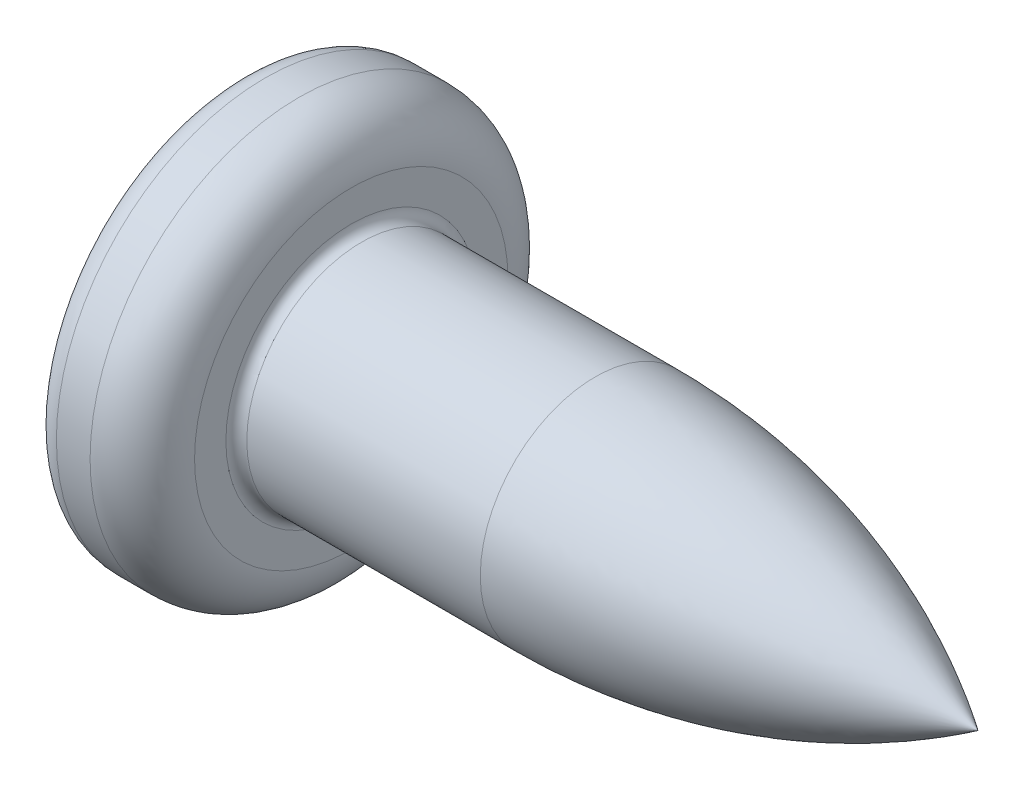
ISO-10303-21;
HEADER;
FILE_DESCRIPTION(('STEP AP214'),'2;1');
FILE_NAME('part.step','',(''),(''),'','','');
FILE_SCHEMA(('AUTOMOTIVE_DESIGN { 1 0 10303 214 1 1 1 1 }'));
ENDSEC;
DATA;
#1=APPLICATION_CONTEXT('core data for automotive mechanical design processes');
#2=APPLICATION_PROTOCOL_DEFINITION('international standard','automotive_design',2000,#1);
#3=PRODUCT_CONTEXT('',#1,'mechanical');
#4=PRODUCT('Part','Part','',(#3));
#5=PRODUCT_RELATED_PRODUCT_CATEGORY('part','',(#4));
#6=PRODUCT_DEFINITION_FORMATION('','',#4);
#7=PRODUCT_DEFINITION_CONTEXT('part definition',#1,'design');
#8=PRODUCT_DEFINITION('design','',#6,#7);
#9=PRODUCT_DEFINITION_SHAPE('','',#8);
#10=(LENGTH_UNIT() NAMED_UNIT(*) SI_UNIT(.MILLI.,.METRE.));
#11=(NAMED_UNIT(*) PLANE_ANGLE_UNIT() SI_UNIT($,.RADIAN.));
#12=(NAMED_UNIT(*) SI_UNIT($,.STERADIAN.) SOLID_ANGLE_UNIT());
#13=UNCERTAINTY_MEASURE_WITH_UNIT(LENGTH_MEASURE(1.E-05),#10,'distance_accuracy_value','');
#14=(GEOMETRIC_REPRESENTATION_CONTEXT(3) GLOBAL_UNCERTAINTY_ASSIGNED_CONTEXT((#13)) GLOBAL_UNIT_ASSIGNED_CONTEXT((#10,
#11,#12)) REPRESENTATION_CONTEXT('',''));
#15=CARTESIAN_POINT('',(0.,0.,0.));
#16=DIRECTION('',(0.,0.,1.));
#17=DIRECTION('',(1.,0.,0.));
#18=AXIS2_PLACEMENT_3D('',#15,#16,#17);
#19=CARTESIAN_POINT('',(4.,0.,0.));
#20=DIRECTION('',(-1.,0.,0.));
#21=DIRECTION('',(0.,1.,0.));
#22=AXIS2_PLACEMENT_3D('',#19,#20,#21);
#23=SPHERICAL_SURFACE('',#22,4.);
#24=CARTESIAN_POINT('',(0.465266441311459,0.,0.));
#25=DIRECTION('',(-1.,0.,0.));
#26=DIRECTION('',(0.,0.,1.));
#27=AXIS2_PLACEMENT_3D('',#24,#25,#26);
#28=CIRCLE('',#27,1.87234042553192);
#29=CARTESIAN_POINT('',(0.465266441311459,0.,1.87234042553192));
#30=VERTEX_POINT('',#29);
#31=EDGE_CURVE('E321',#30,#30,#28,.T.);
#32=ORIENTED_EDGE('',*,*,#31,.T.);
#33=EDGE_LOOP('',(#32));
#34=FACE_BOUND('',#33,.T.);
#35=CARTESIAN_POINT('',(0.0543400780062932,0.,0.));
#36=DIRECTION('',(1.,0.,0.));
#37=DIRECTION('',(0.,0.,-1.));
#38=AXIS2_PLACEMENT_3D('',#35,#36,#37);
#39=CIRCLE('',#38,0.657090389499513);
#40=CARTESIAN_POINT('',(0.0543400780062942,-0.369999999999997,-0.543017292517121));
#41=VERTEX_POINT('',#40);
#42=CARTESIAN_POINT('',(0.0543400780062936,-0.543017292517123,-0.37));
#43=VERTEX_POINT('',#42);
#44=EDGE_CURVE('E457',#41,#43,#39,.F.);
#45=ORIENTED_EDGE('',*,*,#44,.F.);
#46=CARTESIAN_POINT('',(4.,-0.37,0.));
#47=DIRECTION('',(0.,1.,0.));
#48=DIRECTION('',(0.,0.,1.));
#49=AXIS2_PLACEMENT_3D('',#46,#47,#48);
#50=CIRCLE('',#49,3.98285073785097);
#51=CARTESIAN_POINT('',(0.201999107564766,-0.369999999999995,-1.19928696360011));
#52=VERTEX_POINT('',#51);
#53=EDGE_CURVE('E283',#52,#41,#50,.T.);
#54=ORIENTED_EDGE('',*,*,#53,.F.);
#55=CARTESIAN_POINT('',(3.72274316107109,0.,0.556091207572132));
#56=DIRECTION('',(0.446197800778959,0.,-0.89493436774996));
#57=DIRECTION('',(-0.89493436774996,0.,-0.446197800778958));
#58=AXIS2_PLACEMENT_3D('',#55,#56,#57);
#59=CIRCLE('',#58,3.95144166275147);
#60=CARTESIAN_POINT('',(0.201999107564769,0.370000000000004,-1.19928696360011));
#61=VERTEX_POINT('',#60);
#62=EDGE_CURVE('E255',#52,#61,#59,.T.);
#63=ORIENTED_EDGE('',*,*,#62,.T.);
#64=CARTESIAN_POINT('',(4.,0.37,0.));
#65=DIRECTION('',(0.,-1.,0.));
#66=DIRECTION('',(0.,0.,-1.));
#67=AXIS2_PLACEMENT_3D('',#64,#65,#66);
#68=CIRCLE('',#67,3.98285073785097);
#69=CARTESIAN_POINT('',(0.0543400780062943,0.370000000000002,-0.543017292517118));
#70=VERTEX_POINT('',#69);
#71=EDGE_CURVE('E291',#70,#61,#68,.T.);
#72=ORIENTED_EDGE('',*,*,#71,.F.);
#73=CARTESIAN_POINT('',(0.0543400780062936,0.543017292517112,-0.37));
#74=VERTEX_POINT('',#73);
#75=EDGE_CURVE('E370',#74,#70,#39,.F.);
#76=ORIENTED_EDGE('',*,*,#75,.F.);
#77=CARTESIAN_POINT('',(4.,0.,-0.37));
#78=DIRECTION('',(0.,0.,1.));
#79=DIRECTION('',(0.,-1.,0.));
#80=AXIS2_PLACEMENT_3D('',#77,#78,#79);
#81=CIRCLE('',#80,3.98285073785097);
#82=CARTESIAN_POINT('',(0.201999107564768,1.19928696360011,-0.37));
#83=VERTEX_POINT('',#82);
#84=EDGE_CURVE('E249',#83,#74,#81,.T.);
#85=ORIENTED_EDGE('',*,*,#84,.F.);
#86=CARTESIAN_POINT('',(3.72274316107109,-0.556091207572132,0.));
#87=DIRECTION('',(0.446197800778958,0.89493436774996,0.));
#88=DIRECTION('',(-0.89493436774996,0.446197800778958,0.));
#89=AXIS2_PLACEMENT_3D('',#86,#87,#88);
#90=CIRCLE('',#89,3.95144166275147);
#91=CARTESIAN_POINT('',(0.201999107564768,1.19928696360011,0.369999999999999));
#92=VERTEX_POINT('',#91);
#93=EDGE_CURVE('E252',#83,#92,#90,.T.);
#94=ORIENTED_EDGE('',*,*,#93,.T.);
#95=CARTESIAN_POINT('',(4.,0.,0.37));
#96=DIRECTION('',(0.,0.,-1.));
#97=DIRECTION('',(0.,1.,0.));
#98=AXIS2_PLACEMENT_3D('',#95,#96,#97);
#99=CIRCLE('',#98,3.98285073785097);
#100=CARTESIAN_POINT('',(0.0543400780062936,0.543017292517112,0.37));
#101=VERTEX_POINT('',#100);
#102=EDGE_CURVE('E245',#101,#92,#99,.T.);
#103=ORIENTED_EDGE('',*,*,#102,.F.);
#104=CARTESIAN_POINT('',(0.054340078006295,0.369999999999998,0.54301729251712));
#105=VERTEX_POINT('',#104);
#106=EDGE_CURVE('E403',#105,#101,#39,.F.);
#107=ORIENTED_EDGE('',*,*,#106,.F.);
#108=CARTESIAN_POINT('',(0.201999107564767,0.369999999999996,1.19928696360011));
#109=VERTEX_POINT('',#108);
#110=EDGE_CURVE('E265',#109,#105,#68,.T.);
#111=ORIENTED_EDGE('',*,*,#110,.F.);
#112=CARTESIAN_POINT('',(3.72274316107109,0.,-0.556091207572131));
#113=DIRECTION('',(0.446197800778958,0.,0.89493436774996));
#114=DIRECTION('',(0.89493436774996,0.,-0.446197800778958));
#115=AXIS2_PLACEMENT_3D('',#112,#113,#114);
#116=CIRCLE('',#115,3.95144166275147);
#117=CARTESIAN_POINT('',(0.201999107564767,-0.370000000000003,1.19928696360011));
#118=VERTEX_POINT('',#117);
#119=EDGE_CURVE('E40',#109,#118,#116,.T.);
#120=ORIENTED_EDGE('',*,*,#119,.T.);
#121=CARTESIAN_POINT('',(0.0543400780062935,-0.370000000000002,0.543017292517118));
#122=VERTEX_POINT('',#121);
#123=EDGE_CURVE('E262',#122,#118,#50,.T.);
#124=ORIENTED_EDGE('',*,*,#123,.F.);
#125=CARTESIAN_POINT('',(0.0543400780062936,-0.543017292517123,0.369999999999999));
#126=VERTEX_POINT('',#125);
#127=EDGE_CURVE('E442',#126,#122,#39,.F.);
#128=ORIENTED_EDGE('',*,*,#127,.F.);
#129=CARTESIAN_POINT('',(0.201999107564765,-1.19928696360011,0.369999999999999));
#130=VERTEX_POINT('',#129);
#131=EDGE_CURVE('E246',#130,#126,#99,.T.);
#132=ORIENTED_EDGE('',*,*,#131,.F.);
#133=CARTESIAN_POINT('',(3.72274316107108,0.556091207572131,0.));
#134=DIRECTION('',(0.446197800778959,-0.89493436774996,0.));
#135=DIRECTION('',(0.89493436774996,0.446197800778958,0.));
#136=AXIS2_PLACEMENT_3D('',#133,#134,#135);
#137=CIRCLE('',#136,3.95144166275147);
#138=CARTESIAN_POINT('',(0.201999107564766,-1.19928696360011,-0.37));
#139=VERTEX_POINT('',#138);
#140=EDGE_CURVE('E242',#130,#139,#137,.T.);
#141=ORIENTED_EDGE('',*,*,#140,.T.);
#142=EDGE_CURVE('E55',#43,#139,#81,.T.);
#143=ORIENTED_EDGE('',*,*,#142,.F.);
#144=EDGE_LOOP('',(#45,#54,#63,#72,#76,#85,#94,#103,#107,#111,#120,#124,#128,#132,#141,#143));
#145=FACE_BOUND('',#144,.T.);
#146=ADVANCED_FACE('F27',(#34,#145),#23,.T.);
#147=CARTESIAN_POINT('',(1.5,0.552127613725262,-0.37));
#148=DIRECTION('',(0.,0.,1.));
#149=DIRECTION('',(0.,-1.,0.));
#150=AXIS2_PLACEMENT_3D('',#147,#148,#149);
#151=PLANE('',#150);
#152=ORIENTED_EDGE('',*,*,#84,.T.);
#153=CARTESIAN_POINT('',(-0.984107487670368,0.62894390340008,-0.37));
#154=CARTESIAN_POINT('',(-0.783603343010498,0.61266994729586,-0.37));
#155=CARTESIAN_POINT('',(-0.583110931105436,0.596248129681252,-0.37));
#156=CARTESIAN_POINT('',(-0.18215578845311,0.562989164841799,-0.37));
#157=CARTESIAN_POINT('',(0.0183069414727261,0.546152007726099,-0.37));
#158=CARTESIAN_POINT('',(0.419186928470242,0.511943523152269,-0.37));
#159=CARTESIAN_POINT('',(0.619604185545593,0.494572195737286,-0.37));
#160=CARTESIAN_POINT('',(1.02037173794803,0.459102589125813,-0.37));
#161=CARTESIAN_POINT('',(1.2207220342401,0.441004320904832,-0.37));
#162=CARTESIAN_POINT('',(1.53631168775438,0.411665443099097,-0.37));
#163=CARTESIAN_POINT('',(1.65158348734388,0.400774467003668,-0.37));
#164=CARTESIAN_POINT('',(1.88208360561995,0.378547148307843,-0.37));
#165=CARTESIAN_POINT('',(1.99731192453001,0.367210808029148,-0.37));
#166=CARTESIAN_POINT('',(2.22771614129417,0.343963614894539,-0.37));
#167=CARTESIAN_POINT('',(2.34289203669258,0.332052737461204,-0.37));
#168=CARTESIAN_POINT('',(2.57315819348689,0.307413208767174,-0.37));
#169=CARTESIAN_POINT('',(2.68824845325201,0.294684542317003,-0.37));
#170=CARTESIAN_POINT('',(2.80327961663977,0.281425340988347,-0.37));
#171=B_SPLINE_CURVE_WITH_KNOTS('',3,(#153,#154,#155,#156,#157,#158,#159,#160,#161,#162,#163,
#164,#165,#166,#167,#168,#169,#170),.UNSPECIFIED.,.F.,.F.,(4,2,2,2,2,2,2,2,4),(0.,
0.603490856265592,1.20699609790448,1.81050129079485,2.41399737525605,2.76135214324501,
3.1087051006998,3.45607293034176,3.80344721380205),.UNSPECIFIED.);
#172=CARTESIAN_POINT('',(1.5,0.415013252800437,-0.370000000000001));
#173=VERTEX_POINT('',#172);
#174=EDGE_CURVE('E363',#74,#173,#171,.T.);
#175=ORIENTED_EDGE('',*,*,#174,.T.);
#176=DIRECTION('',(0.,1.,0.));
#177=VECTOR('',#176,1.);
#178=CARTESIAN_POINT('',(1.5,-0.552127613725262,-0.37));
#179=LINE('',#178,#177);
#180=CARTESIAN_POINT('',(1.5,0.552127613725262,-0.37));
#181=VERTEX_POINT('',#180);
#182=EDGE_CURVE('E308',#173,#181,#179,.T.);
#183=ORIENTED_EDGE('',*,*,#182,.T.);
#184=DIRECTION('',(0.89493436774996,-0.446197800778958,0.));
#185=VECTOR('',#184,1.);
#186=CARTESIAN_POINT('',(0.,1.3,-0.37));
#187=LINE('',#186,#185);
#188=EDGE_CURVE('E314',#83,#181,#187,.T.);
#189=ORIENTED_EDGE('',*,*,#188,.F.);
#190=EDGE_LOOP('',(#152,#175,#183,#189));
#191=FACE_BOUND('',#190,.T.);
#192=ADVANCED_FACE('F188',(#191),#151,.T.);
#193=CARTESIAN_POINT('',(1.5,-0.552127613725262,-0.37));
#194=VERTEX_POINT('',#193);
#195=CARTESIAN_POINT('',(1.5,-0.415013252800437,-0.370000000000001));
#196=VERTEX_POINT('',#195);
#197=EDGE_CURVE('E305',#194,#196,#179,.T.);
#198=ORIENTED_EDGE('',*,*,#197,.T.);
#199=CARTESIAN_POINT('',(-0.984107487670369,-0.62894390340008,-0.37));
#200=CARTESIAN_POINT('',(-0.783603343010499,-0.61266994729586,-0.37));
#201=CARTESIAN_POINT('',(-0.583110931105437,-0.596248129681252,-0.37));
#202=CARTESIAN_POINT('',(-0.182155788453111,-0.562989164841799,-0.37));
#203=CARTESIAN_POINT('',(0.0183069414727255,-0.5461520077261,-0.37));
#204=CARTESIAN_POINT('',(0.419186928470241,-0.511943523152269,-0.37));
#205=CARTESIAN_POINT('',(0.619604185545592,-0.494572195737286,-0.37));
#206=CARTESIAN_POINT('',(1.02037173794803,-0.459102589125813,-0.37));
#207=CARTESIAN_POINT('',(1.22072203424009,-0.441004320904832,-0.37));
#208=CARTESIAN_POINT('',(1.53631168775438,-0.411665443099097,-0.37));
#209=CARTESIAN_POINT('',(1.65158348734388,-0.400774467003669,-0.37));
#210=CARTESIAN_POINT('',(1.88208360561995,-0.378547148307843,-0.37));
#211=CARTESIAN_POINT('',(1.99731192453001,-0.367210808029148,-0.37));
#212=CARTESIAN_POINT('',(2.22771614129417,-0.343963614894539,-0.37));
#213=CARTESIAN_POINT('',(2.34289203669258,-0.332052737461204,-0.37));
#214=CARTESIAN_POINT('',(2.57315819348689,-0.307413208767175,-0.37));
#215=CARTESIAN_POINT('',(2.68824845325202,-0.294684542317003,-0.37));
#216=CARTESIAN_POINT('',(2.80327961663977,-0.281425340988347,-0.37));
#217=B_SPLINE_CURVE_WITH_KNOTS('',3,(#199,#200,#201,#202,#203,#204,#205,#206,#207,#208,#209,
#210,#211,#212,#213,#214,#215,#216),.UNSPECIFIED.,.F.,.F.,(4,2,2,2,2,2,2,2,4),(0.,
0.603490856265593,1.20699609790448,1.81050129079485,2.41399737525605,2.76135214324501,
3.1087051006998,3.45607293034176,3.80344721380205),.UNSPECIFIED.);
#218=EDGE_CURVE('E356',#196,#43,#217,.F.);
#219=ORIENTED_EDGE('',*,*,#218,.T.);
#220=ORIENTED_EDGE('',*,*,#142,.T.);
#221=DIRECTION('',(0.89493436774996,0.446197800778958,0.));
#222=VECTOR('',#221,1.);
#223=CARTESIAN_POINT('',(0.,-1.3,-0.37));
#224=LINE('',#223,#222);
#225=EDGE_CURVE('E311',#139,#194,#224,.T.);
#226=ORIENTED_EDGE('',*,*,#225,.T.);
#227=EDGE_LOOP('',(#198,#219,#220,#226));
#228=FACE_BOUND('',#227,.T.);
#229=ADVANCED_FACE('F195',(#228),#151,.T.);
#230=CARTESIAN_POINT('',(1.5,-0.552127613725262,0.369999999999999));
#231=DIRECTION('',(0.,0.,-1.));
#232=DIRECTION('',(0.,1.,0.));
#233=AXIS2_PLACEMENT_3D('',#230,#231,#232);
#234=PLANE('',#233);
#235=DIRECTION('',(0.,-1.,0.));
#236=VECTOR('',#235,1.);
#237=CARTESIAN_POINT('',(1.5,0.552127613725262,0.37));
#238=LINE('',#237,#236);
#239=CARTESIAN_POINT('',(1.5,0.552127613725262,0.37));
#240=VERTEX_POINT('',#239);
#241=CARTESIAN_POINT('',(1.5,0.415013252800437,0.370000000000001));
#242=VERTEX_POINT('',#241);
#243=EDGE_CURVE('E297',#240,#242,#238,.T.);
#244=ORIENTED_EDGE('',*,*,#243,.T.);
#245=CARTESIAN_POINT('',(-0.984107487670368,0.62894390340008,0.37));
#246=CARTESIAN_POINT('',(-0.783603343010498,0.61266994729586,0.37));
#247=CARTESIAN_POINT('',(-0.583110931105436,0.596248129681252,0.37));
#248=CARTESIAN_POINT('',(-0.18215578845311,0.562989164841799,0.37));
#249=CARTESIAN_POINT('',(0.0183069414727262,0.5461520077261,0.37));
#250=CARTESIAN_POINT('',(0.419186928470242,0.511943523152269,0.37));
#251=CARTESIAN_POINT('',(0.619604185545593,0.494572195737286,0.37));
#252=CARTESIAN_POINT('',(1.02037173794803,0.459102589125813,0.37));
#253=CARTESIAN_POINT('',(1.22072203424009,0.441004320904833,0.37));
#254=CARTESIAN_POINT('',(1.53631168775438,0.411665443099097,0.37));
#255=CARTESIAN_POINT('',(1.65158348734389,0.400774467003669,0.37));
#256=CARTESIAN_POINT('',(1.88208360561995,0.378547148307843,0.37));
#257=CARTESIAN_POINT('',(1.99731192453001,0.367210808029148,0.37));
#258=CARTESIAN_POINT('',(2.22771614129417,0.343963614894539,0.37));
#259=CARTESIAN_POINT('',(2.34289203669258,0.332052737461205,0.37));
#260=CARTESIAN_POINT('',(2.57315819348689,0.307413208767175,0.37));
#261=CARTESIAN_POINT('',(2.68824845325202,0.294684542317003,0.37));
#262=CARTESIAN_POINT('',(2.80327961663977,0.281425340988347,0.37));
#263=B_SPLINE_CURVE_WITH_KNOTS('',3,(#245,#246,#247,#248,#249,#250,#251,#252,#253,#254,#255,
#256,#257,#258,#259,#260,#261,#262),.UNSPECIFIED.,.F.,.F.,(4,2,2,2,2,2,2,2,4),(0.,
0.603490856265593,1.20699609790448,1.81050129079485,2.41399737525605,2.76135214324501,
3.1087051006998,3.45607293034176,3.80344721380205),.UNSPECIFIED.);
#264=EDGE_CURVE('E404',#242,#101,#263,.F.);
#265=ORIENTED_EDGE('',*,*,#264,.T.);
#266=ORIENTED_EDGE('',*,*,#102,.T.);
#267=DIRECTION('',(0.89493436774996,-0.446197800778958,0.));
#268=VECTOR('',#267,1.);
#269=CARTESIAN_POINT('',(0.,1.3,0.37));
#270=LINE('',#269,#268);
#271=EDGE_CURVE('E313',#92,#240,#270,.T.);
#272=ORIENTED_EDGE('',*,*,#271,.T.);
#273=EDGE_LOOP('',(#244,#265,#266,#272));
#274=FACE_BOUND('',#273,.T.);
#275=ADVANCED_FACE('F351',(#274),#234,.T.);
#276=ORIENTED_EDGE('',*,*,#131,.T.);
#277=CARTESIAN_POINT('',(-0.984107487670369,-0.62894390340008,0.369999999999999));
#278=CARTESIAN_POINT('',(-0.783603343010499,-0.612669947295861,0.369999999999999));
#279=CARTESIAN_POINT('',(-0.583110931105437,-0.596248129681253,0.369999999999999));
#280=CARTESIAN_POINT('',(-0.18215578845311,-0.5629891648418,0.369999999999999));
#281=CARTESIAN_POINT('',(0.0183069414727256,-0.5461520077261,0.369999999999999));
#282=CARTESIAN_POINT('',(0.419186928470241,-0.511943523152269,0.369999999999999));
#283=CARTESIAN_POINT('',(0.619604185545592,-0.494572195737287,0.369999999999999));
#284=CARTESIAN_POINT('',(1.02037173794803,-0.459102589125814,0.369999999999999));
#285=CARTESIAN_POINT('',(1.22072203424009,-0.441004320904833,0.369999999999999));
#286=CARTESIAN_POINT('',(1.53631168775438,-0.411665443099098,0.369999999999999));
#287=CARTESIAN_POINT('',(1.65158348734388,-0.400774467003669,0.37));
#288=CARTESIAN_POINT('',(1.88208360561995,-0.378547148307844,0.37));
#289=CARTESIAN_POINT('',(1.99731192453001,-0.367210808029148,0.37));
#290=CARTESIAN_POINT('',(2.22771614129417,-0.34396361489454,0.37));
#291=CARTESIAN_POINT('',(2.34289203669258,-0.332052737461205,0.37));
#292=CARTESIAN_POINT('',(2.57315819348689,-0.307413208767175,0.37));
#293=CARTESIAN_POINT('',(2.68824845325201,-0.294684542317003,0.37));
#294=CARTESIAN_POINT('',(2.80327961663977,-0.281425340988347,0.37));
#295=B_SPLINE_CURVE_WITH_KNOTS('',3,(#277,#278,#279,#280,#281,#282,#283,#284,#285,#286,#287,
#288,#289,#290,#291,#292,#293,#294),.UNSPECIFIED.,.F.,.F.,(4,2,2,2,2,2,2,2,4),(0.,
0.603490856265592,1.20699609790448,1.81050129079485,2.41399737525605,2.76135214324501,
3.1087051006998,3.45607293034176,3.80344721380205),.UNSPECIFIED.);
#296=CARTESIAN_POINT('',(1.5,-0.415013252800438,0.37));
#297=VERTEX_POINT('',#296);
#298=EDGE_CURVE('E394',#126,#297,#295,.T.);
#299=ORIENTED_EDGE('',*,*,#298,.T.);
#300=CARTESIAN_POINT('',(1.5,-0.552127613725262,0.369999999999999));
#301=VERTEX_POINT('',#300);
#302=EDGE_CURVE('E300',#297,#301,#238,.T.);
#303=ORIENTED_EDGE('',*,*,#302,.T.);
#304=DIRECTION('',(0.89493436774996,0.446197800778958,0.));
#305=VECTOR('',#304,1.);
#306=CARTESIAN_POINT('',(0.,-1.3,0.369999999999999));
#307=LINE('',#306,#305);
#308=EDGE_CURVE('E295',#130,#301,#307,.T.);
#309=ORIENTED_EDGE('',*,*,#308,.F.);
#310=EDGE_LOOP('',(#276,#299,#303,#309));
#311=FACE_BOUND('',#310,.T.);
#312=ADVANCED_FACE('F347',(#311),#234,.T.);
#313=CARTESIAN_POINT('',(1.5,0.552127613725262,0.37));
#314=DIRECTION('',(0.446197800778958,0.89493436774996,0.));
#315=DIRECTION('',(-0.89493436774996,0.446197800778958,0.));
#316=AXIS2_PLACEMENT_3D('',#313,#314,#315);
#317=PLANE('',#316);
#318=CARTESIAN_POINT('',(2.47007520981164,0.0684659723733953,0.));
#319=DIRECTION('',(0.446197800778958,0.89493436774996,0.));
#320=DIRECTION('',(-0.89493436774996,0.446197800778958,0.));
#321=AXIS2_PLACEMENT_3D('',#318,#319,#320);
#322=ELLIPSE('',#321,1.09405678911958,0.483340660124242);
#323=CARTESIAN_POINT('',(1.5,0.552127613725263,0.0655064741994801));
#324=VERTEX_POINT('',#323);
#325=CARTESIAN_POINT('',(1.5,0.552127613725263,-0.0655064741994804));
#326=VERTEX_POINT('',#325);
#327=EDGE_CURVE('E434',#324,#326,#322,.F.);
#328=ORIENTED_EDGE('',*,*,#327,.F.);
#329=DIRECTION('',(0.,0.,-1.));
#330=VECTOR('',#329,1.);
#331=CARTESIAN_POINT('',(1.5,0.552127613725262,0.37));
#332=LINE('',#331,#330);
#333=EDGE_CURVE('E301',#240,#324,#332,.T.);
#334=ORIENTED_EDGE('',*,*,#333,.F.);
#335=ORIENTED_EDGE('',*,*,#271,.F.);
#336=ORIENTED_EDGE('',*,*,#93,.F.);
#337=ORIENTED_EDGE('',*,*,#188,.T.);
#338=EDGE_CURVE('E304',#326,#181,#332,.T.);
#339=ORIENTED_EDGE('',*,*,#338,.F.);
#340=EDGE_LOOP('',(#328,#334,#335,#336,#337,#339));
#341=FACE_BOUND('',#340,.T.);
#342=ADVANCED_FACE('F344',(#341),#317,.F.);
#343=CARTESIAN_POINT('',(0.,-1.3,-0.37));
#344=DIRECTION('',(0.446197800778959,-0.89493436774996,0.));
#345=DIRECTION('',(0.89493436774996,0.446197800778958,0.));
#346=AXIS2_PLACEMENT_3D('',#343,#344,#345);
#347=PLANE('',#346);
#348=CARTESIAN_POINT('',(2.47007520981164,-0.0684659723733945,0.));
#349=DIRECTION('',(0.446197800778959,-0.89493436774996,0.));
#350=DIRECTION('',(-0.89493436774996,-0.446197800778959,0.));
#351=AXIS2_PLACEMENT_3D('',#348,#349,#350);
#352=ELLIPSE('',#351,1.09405678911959,0.483340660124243);
#353=CARTESIAN_POINT('',(1.5,-0.552127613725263,-0.0655064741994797));
#354=VERTEX_POINT('',#353);
#355=CARTESIAN_POINT('',(1.5,-0.552127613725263,0.0655064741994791));
#356=VERTEX_POINT('',#355);
#357=EDGE_CURVE('E430',#354,#356,#352,.F.);
#358=ORIENTED_EDGE('',*,*,#357,.F.);
#359=DIRECTION('',(0.,0.,1.));
#360=VECTOR('',#359,1.);
#361=CARTESIAN_POINT('',(1.5,-0.552127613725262,-0.37));
#362=LINE('',#361,#360);
#363=EDGE_CURVE('E292',#194,#354,#362,.T.);
#364=ORIENTED_EDGE('',*,*,#363,.F.);
#365=ORIENTED_EDGE('',*,*,#225,.F.);
#366=ORIENTED_EDGE('',*,*,#140,.F.);
#367=ORIENTED_EDGE('',*,*,#308,.T.);
#368=EDGE_CURVE('E296',#356,#301,#362,.T.);
#369=ORIENTED_EDGE('',*,*,#368,.F.);
#370=EDGE_LOOP('',(#358,#364,#365,#366,#367,#369));
#371=FACE_BOUND('',#370,.T.);
#372=ADVANCED_FACE('F346',(#371),#347,.F.);
#373=CARTESIAN_POINT('',(1.5,0.552127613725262,-0.37));
#374=DIRECTION('',(-1.,0.,0.));
#375=DIRECTION('',(0.,0.,1.));
#376=AXIS2_PLACEMENT_3D('',#373,#374,#375);
#377=PLANE('',#376);
#378=DIRECTION('',(0.,1.,0.));
#379=VECTOR('',#378,1.);
#380=CARTESIAN_POINT('',(1.5,-0.370000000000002,0.55212761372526));
#381=LINE('',#380,#379);
#382=CARTESIAN_POINT('',(1.5,-0.370000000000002,0.55212761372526));
#383=VERTEX_POINT('',#382);
#384=CARTESIAN_POINT('',(1.5,-0.0655064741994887,0.552127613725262));
#385=VERTEX_POINT('',#384);
#386=EDGE_CURVE('E498',#383,#385,#381,.T.);
#387=ORIENTED_EDGE('',*,*,#386,.T.);
#388=CARTESIAN_POINT('',(1.5,0.,0.));
#389=DIRECTION('',(-1.,0.,0.));
#390=DIRECTION('',(0.,0.,1.));
#391=AXIS2_PLACEMENT_3D('',#388,#389,#390);
#392=CIRCLE('',#391,0.556);
#393=CARTESIAN_POINT('',(1.5,-0.370000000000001,0.415013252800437));
#394=VERTEX_POINT('',#393);
#395=EDGE_CURVE('E455',#394,#385,#392,.T.);
#396=ORIENTED_EDGE('',*,*,#395,.F.);
#397=DIRECTION('',(0.,0.,-1.));
#398=VECTOR('',#397,1.);
#399=CARTESIAN_POINT('',(1.5,-0.370000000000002,0.55212761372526));
#400=LINE('',#399,#398);
#401=EDGE_CURVE('E493',#383,#394,#400,.T.);
#402=ORIENTED_EDGE('',*,*,#401,.F.);
#403=EDGE_LOOP('',(#387,#396,#402));
#404=FACE_BOUND('',#403,.T.);
#405=ADVANCED_FACE('F419',(#404),#377,.T.);
#406=ORIENTED_EDGE('',*,*,#302,.F.);
#407=EDGE_CURVE('E450',#356,#297,#392,.T.);
#408=ORIENTED_EDGE('',*,*,#407,.F.);
#409=ORIENTED_EDGE('',*,*,#368,.T.);
#410=EDGE_LOOP('',(#406,#408,#409));
#411=FACE_BOUND('',#410,.T.);
#412=ADVANCED_FACE('F421',(#411),#377,.T.);
#413=ORIENTED_EDGE('',*,*,#363,.T.);
#414=EDGE_CURVE('E439',#196,#354,#392,.T.);
#415=ORIENTED_EDGE('',*,*,#414,.F.);
#416=ORIENTED_EDGE('',*,*,#197,.F.);
#417=EDGE_LOOP('',(#413,#415,#416));
#418=FACE_BOUND('',#417,.T.);
#419=ADVANCED_FACE('F437',(#418),#377,.T.);
#420=CARTESIAN_POINT('',(1.5,-0.369999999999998,-0.415013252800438));
#421=VERTEX_POINT('',#420);
#422=CARTESIAN_POINT('',(1.5,-0.369999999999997,-0.552127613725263));
#423=VERTEX_POINT('',#422);
#424=EDGE_CURVE('E487',#421,#423,#400,.T.);
#425=ORIENTED_EDGE('',*,*,#424,.F.);
#426=CARTESIAN_POINT('',(1.5,-0.0655064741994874,-0.552127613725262));
#427=VERTEX_POINT('',#426);
#428=EDGE_CURVE('E47',#427,#421,#392,.T.);
#429=ORIENTED_EDGE('',*,*,#428,.F.);
#430=DIRECTION('',(0.,-1.,0.));
#431=VECTOR('',#430,1.);
#432=CARTESIAN_POINT('',(1.5,0.370000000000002,-0.55212761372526));
#433=LINE('',#432,#431);
#434=EDGE_CURVE('E485',#427,#423,#433,.T.);
#435=ORIENTED_EDGE('',*,*,#434,.T.);
#436=EDGE_LOOP('',(#425,#429,#435));
#437=FACE_BOUND('',#436,.T.);
#438=ADVANCED_FACE('F484',(#437),#377,.T.);
#439=CARTESIAN_POINT('',(1.5,0.370000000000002,-0.55212761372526));
#440=VERTEX_POINT('',#439);
#441=CARTESIAN_POINT('',(1.5,0.0655064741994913,-0.552127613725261));
#442=VERTEX_POINT('',#441);
#443=EDGE_CURVE('E492',#440,#442,#433,.T.);
#444=ORIENTED_EDGE('',*,*,#443,.T.);
#445=CARTESIAN_POINT('',(1.5,0.370000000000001,-0.415013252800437));
#446=VERTEX_POINT('',#445);
#447=EDGE_CURVE('E481',#446,#442,#392,.T.);
#448=ORIENTED_EDGE('',*,*,#447,.F.);
#449=DIRECTION('',(0.,0.,1.));
#450=VECTOR('',#449,1.);
#451=CARTESIAN_POINT('',(1.5,0.370000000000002,-0.55212761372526));
#452=LINE('',#451,#450);
#453=EDGE_CURVE('E502',#440,#446,#452,.T.);
#454=ORIENTED_EDGE('',*,*,#453,.F.);
#455=EDGE_LOOP('',(#444,#448,#454));
#456=FACE_BOUND('',#455,.T.);
#457=ADVANCED_FACE('F509',(#456),#377,.T.);
#458=ORIENTED_EDGE('',*,*,#182,.F.);
#459=EDGE_CURVE('E511',#326,#173,#392,.T.);
#460=ORIENTED_EDGE('',*,*,#459,.F.);
#461=ORIENTED_EDGE('',*,*,#338,.T.);
#462=EDGE_LOOP('',(#458,#460,#461));
#463=FACE_BOUND('',#462,.T.);
#464=ADVANCED_FACE('F537',(#463),#377,.T.);
#465=ORIENTED_EDGE('',*,*,#333,.T.);
#466=EDGE_CURVE('E516',#242,#324,#392,.T.);
#467=ORIENTED_EDGE('',*,*,#466,.F.);
#468=ORIENTED_EDGE('',*,*,#243,.F.);
#469=EDGE_LOOP('',(#465,#467,#468));
#470=FACE_BOUND('',#469,.T.);
#471=ADVANCED_FACE('F525',(#470),#377,.T.);
#472=CARTESIAN_POINT('',(1.5,0.369999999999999,0.415013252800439));
#473=VERTEX_POINT('',#472);
#474=CARTESIAN_POINT('',(1.5,0.369999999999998,0.552127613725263));
#475=VERTEX_POINT('',#474);
#476=EDGE_CURVE('E280',#473,#475,#452,.T.);
#477=ORIENTED_EDGE('',*,*,#476,.F.);
#478=CARTESIAN_POINT('',(1.5,0.0655064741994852,0.552127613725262));
#479=VERTEX_POINT('',#478);
#480=EDGE_CURVE('E456',#479,#473,#392,.T.);
#481=ORIENTED_EDGE('',*,*,#480,.F.);
#482=EDGE_CURVE('E501',#479,#475,#381,.T.);
#483=ORIENTED_EDGE('',*,*,#482,.T.);
#484=EDGE_LOOP('',(#477,#481,#483));
#485=FACE_BOUND('',#484,.T.);
#486=ADVANCED_FACE('F413',(#485),#377,.T.);
#487=CARTESIAN_POINT('',(1.5,0.369999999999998,0.552127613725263));
#488=DIRECTION('',(0.,-1.,0.));
#489=DIRECTION('',(0.,0.,-1.));
#490=AXIS2_PLACEMENT_3D('',#487,#488,#489);
#491=PLANE('',#490);
#492=ORIENTED_EDGE('',*,*,#110,.T.);
#493=CARTESIAN_POINT('',(-0.98410748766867,0.369999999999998,0.628943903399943));
#494=CARTESIAN_POINT('',(-0.783603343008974,0.369999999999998,0.612669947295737));
#495=CARTESIAN_POINT('',(-0.583110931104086,0.369999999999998,0.596248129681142));
#496=CARTESIAN_POINT('',(-0.182155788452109,0.369999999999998,0.562989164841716));
#497=CARTESIAN_POINT('',(0.0183069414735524,0.369999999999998,0.546152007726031));
#498=CARTESIAN_POINT('',(0.419186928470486,0.369999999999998,0.511943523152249));
#499=CARTESIAN_POINT('',(0.619604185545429,0.369999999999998,0.494572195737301));
#500=CARTESIAN_POINT('',(1.02037173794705,0.369999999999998,0.459102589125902));
#501=CARTESIAN_POINT('',(1.22072203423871,0.369999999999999,0.44100432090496));
#502=CARTESIAN_POINT('',(1.53631168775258,0.369999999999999,0.411665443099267));
#503=CARTESIAN_POINT('',(1.65158348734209,0.369999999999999,0.40077446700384));
#504=CARTESIAN_POINT('',(1.88208360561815,0.369999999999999,0.378547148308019));
#505=CARTESIAN_POINT('',(1.99731192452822,0.369999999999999,0.367210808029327));
#506=CARTESIAN_POINT('',(2.22771614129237,0.369999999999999,0.343963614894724));
#507=CARTESIAN_POINT('',(2.34289203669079,0.369999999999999,0.332052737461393));
#508=CARTESIAN_POINT('',(2.5731581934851,0.369999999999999,0.307413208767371));
#509=CARTESIAN_POINT('',(2.68824845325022,0.369999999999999,0.294684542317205));
#510=CARTESIAN_POINT('',(2.80327961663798,0.369999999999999,0.281425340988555));
#511=B_SPLINE_CURVE_WITH_KNOTS('',3,(#493,#494,#495,#496,#497,#498,#499,#500,#501,#502,#503,
#504,#505,#506,#507,#508,#509,#510),.UNSPECIFIED.,.F.,.F.,(4,2,2,2,2,2,2,2,4),(0.,
0.603490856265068,1.20699609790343,1.81050129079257,2.41399737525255,2.7613521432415,
3.1087051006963,3.45607293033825,3.80344721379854),.UNSPECIFIED.);
#512=EDGE_CURVE('E399',#105,#473,#511,.T.);
#513=ORIENTED_EDGE('',*,*,#512,.T.);
#514=ORIENTED_EDGE('',*,*,#476,.T.);
#515=DIRECTION('',(0.89493436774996,0.,-0.446197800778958));
#516=VECTOR('',#515,1.);
#517=CARTESIAN_POINT('',(0.,0.369999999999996,1.3));
#518=LINE('',#517,#516);
#519=EDGE_CURVE('E273',#109,#475,#518,.T.);
#520=ORIENTED_EDGE('',*,*,#519,.F.);
#521=EDGE_LOOP('',(#492,#513,#514,#520));
#522=FACE_BOUND('',#521,.T.);
#523=ADVANCED_FACE('F277',(#522),#491,.T.);
#524=CARTESIAN_POINT('',(1.5,-0.369999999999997,-0.552127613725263));
#525=DIRECTION('',(0.,1.,0.));
#526=DIRECTION('',(0.,0.,1.));
#527=AXIS2_PLACEMENT_3D('',#524,#525,#526);
#528=PLANE('',#527);
#529=ORIENTED_EDGE('',*,*,#401,.T.);
#530=CARTESIAN_POINT('',(-0.984107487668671,-0.370000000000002,0.628943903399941));
#531=CARTESIAN_POINT('',(-0.783603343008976,-0.370000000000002,0.612669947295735));
#532=CARTESIAN_POINT('',(-0.583110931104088,-0.370000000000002,0.59624812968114));
#533=CARTESIAN_POINT('',(-0.18215578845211,-0.370000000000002,0.562989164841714));
#534=CARTESIAN_POINT('',(0.0183069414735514,-0.370000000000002,0.546152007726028));
#535=CARTESIAN_POINT('',(0.419186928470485,-0.370000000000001,0.511943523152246));
#536=CARTESIAN_POINT('',(0.619604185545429,-0.370000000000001,0.494572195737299));
#537=CARTESIAN_POINT('',(1.02037173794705,-0.370000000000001,0.4591025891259));
#538=CARTESIAN_POINT('',(1.22072203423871,-0.370000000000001,0.441004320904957));
#539=CARTESIAN_POINT('',(1.53631168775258,-0.370000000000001,0.411665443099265));
#540=CARTESIAN_POINT('',(1.65158348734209,-0.370000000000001,0.400774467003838));
#541=CARTESIAN_POINT('',(1.88208360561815,-0.370000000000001,0.378547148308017));
#542=CARTESIAN_POINT('',(1.99731192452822,-0.370000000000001,0.367210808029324));
#543=CARTESIAN_POINT('',(2.22771614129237,-0.370000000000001,0.343963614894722));
#544=CARTESIAN_POINT('',(2.34289203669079,-0.370000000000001,0.332052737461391));
#545=CARTESIAN_POINT('',(2.5731581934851,-0.370000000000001,0.307413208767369));
#546=CARTESIAN_POINT('',(2.68824845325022,-0.370000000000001,0.294684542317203));
#547=CARTESIAN_POINT('',(2.80327961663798,-0.370000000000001,0.281425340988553));
#548=B_SPLINE_CURVE_WITH_KNOTS('',3,(#530,#531,#532,#533,#534,#535,#536,#537,#538,#539,#540,
#541,#542,#543,#544,#545,#546,#547),.UNSPECIFIED.,.F.,.F.,(4,2,2,2,2,2,2,2,4),(0.,
0.603490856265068,1.20699609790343,1.81050129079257,2.41399737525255,2.7613521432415,
3.1087051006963,3.45607293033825,3.80344721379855),.UNSPECIFIED.);
#549=EDGE_CURVE('E389',#394,#122,#548,.F.);
#550=ORIENTED_EDGE('',*,*,#549,.T.);
#551=ORIENTED_EDGE('',*,*,#123,.T.);
#552=DIRECTION('',(0.89493436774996,0.,-0.446197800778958));
#553=VECTOR('',#552,1.);
#554=CARTESIAN_POINT('',(0.,-0.370000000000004,1.3));
#555=LINE('',#554,#553);
#556=EDGE_CURVE('E275',#118,#383,#555,.T.);
#557=ORIENTED_EDGE('',*,*,#556,.T.);
#558=EDGE_LOOP('',(#529,#550,#551,#557));
#559=FACE_BOUND('',#558,.T.);
#560=ADVANCED_FACE('F412',(#559),#528,.T.);
#561=CARTESIAN_POINT('',(1.5,-0.370000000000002,0.55212761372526));
#562=DIRECTION('',(0.446197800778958,0.,0.89493436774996));
#563=DIRECTION('',(-0.89493436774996,0.,0.446197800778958));
#564=AXIS2_PLACEMENT_3D('',#561,#562,#563);
#565=PLANE('',#564);
#566=CARTESIAN_POINT('',(2.47007520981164,0.,0.0684659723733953));
#567=DIRECTION('',(0.446197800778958,0.,0.89493436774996));
#568=DIRECTION('',(-0.89493436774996,0.,0.446197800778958));
#569=AXIS2_PLACEMENT_3D('',#566,#567,#568);
#570=ELLIPSE('',#569,1.09405678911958,0.483340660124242);
#571=EDGE_CURVE('E465',#385,#479,#570,.F.);
#572=ORIENTED_EDGE('',*,*,#571,.F.);
#573=ORIENTED_EDGE('',*,*,#386,.F.);
#574=ORIENTED_EDGE('',*,*,#556,.F.);
#575=ORIENTED_EDGE('',*,*,#119,.F.);
#576=ORIENTED_EDGE('',*,*,#519,.T.);
#577=ORIENTED_EDGE('',*,*,#482,.F.);
#578=EDGE_LOOP('',(#572,#573,#574,#575,#576,#577));
#579=FACE_BOUND('',#578,.T.);
#580=ADVANCED_FACE('F271',(#579),#565,.F.);
#581=CARTESIAN_POINT('',(0.,0.370000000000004,-1.3));
#582=DIRECTION('',(0.446197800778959,0.,-0.89493436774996));
#583=DIRECTION('',(0.89493436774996,0.,0.446197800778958));
#584=AXIS2_PLACEMENT_3D('',#581,#582,#583);
#585=PLANE('',#584);
#586=CARTESIAN_POINT('',(2.47007520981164,0.,-0.0684659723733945));
#587=DIRECTION('',(0.446197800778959,0.,-0.89493436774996));
#588=DIRECTION('',(-0.89493436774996,0.,-0.446197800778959));
#589=AXIS2_PLACEMENT_3D('',#586,#587,#588);
#590=ELLIPSE('',#589,1.09405678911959,0.483340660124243);
#591=EDGE_CURVE('E369',#442,#427,#590,.F.);
#592=ORIENTED_EDGE('',*,*,#591,.F.);
#593=ORIENTED_EDGE('',*,*,#443,.F.);
#594=DIRECTION('',(0.89493436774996,0.,0.446197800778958));
#595=VECTOR('',#594,1.);
#596=CARTESIAN_POINT('',(0.,0.370000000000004,-1.3));
#597=LINE('',#596,#595);
#598=EDGE_CURVE('E285',#61,#440,#597,.T.);
#599=ORIENTED_EDGE('',*,*,#598,.F.);
#600=ORIENTED_EDGE('',*,*,#62,.F.);
#601=DIRECTION('',(0.89493436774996,0.,0.446197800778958));
#602=VECTOR('',#601,1.);
#603=CARTESIAN_POINT('',(0.,-0.369999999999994,-1.3));
#604=LINE('',#603,#602);
#605=EDGE_CURVE('E491',#52,#423,#604,.T.);
#606=ORIENTED_EDGE('',*,*,#605,.T.);
#607=ORIENTED_EDGE('',*,*,#434,.F.);
#608=EDGE_LOOP('',(#592,#593,#599,#600,#606,#607));
#609=FACE_BOUND('',#608,.T.);
#610=ADVANCED_FACE('F379',(#609),#585,.F.);
#611=ORIENTED_EDGE('',*,*,#453,.T.);
#612=CARTESIAN_POINT('',(-0.984107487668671,0.370000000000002,-0.628943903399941));
#613=CARTESIAN_POINT('',(-0.783603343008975,0.370000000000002,-0.612669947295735));
#614=CARTESIAN_POINT('',(-0.583110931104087,0.370000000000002,-0.59624812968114));
#615=CARTESIAN_POINT('',(-0.18215578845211,0.370000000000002,-0.562989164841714));
#616=CARTESIAN_POINT('',(0.0183069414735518,0.370000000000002,-0.546152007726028));
#617=CARTESIAN_POINT('',(0.419186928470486,0.370000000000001,-0.511943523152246));
#618=CARTESIAN_POINT('',(0.619604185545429,0.370000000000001,-0.494572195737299));
#619=CARTESIAN_POINT('',(1.02037173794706,0.370000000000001,-0.459102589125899));
#620=CARTESIAN_POINT('',(1.22072203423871,0.370000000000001,-0.441004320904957));
#621=CARTESIAN_POINT('',(1.53631168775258,0.370000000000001,-0.411665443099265));
#622=CARTESIAN_POINT('',(1.65158348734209,0.370000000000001,-0.400774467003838));
#623=CARTESIAN_POINT('',(1.88208360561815,0.370000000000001,-0.378547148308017));
#624=CARTESIAN_POINT('',(1.99731192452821,0.370000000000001,-0.367210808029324));
#625=CARTESIAN_POINT('',(2.22771614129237,0.370000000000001,-0.343963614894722));
#626=CARTESIAN_POINT('',(2.34289203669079,0.370000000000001,-0.332052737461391));
#627=CARTESIAN_POINT('',(2.5731581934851,0.370000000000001,-0.307413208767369));
#628=CARTESIAN_POINT('',(2.68824845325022,0.370000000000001,-0.294684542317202));
#629=CARTESIAN_POINT('',(2.80327961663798,0.370000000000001,-0.281425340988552));
#630=B_SPLINE_CURVE_WITH_KNOTS('',3,(#612,#613,#614,#615,#616,#617,#618,#619,#620,#621,#622,
#623,#624,#625,#626,#627,#628,#629),.UNSPECIFIED.,.F.,.F.,(4,2,2,2,2,2,2,2,4),(0.,
0.603490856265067,1.20699609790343,1.81050129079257,2.41399737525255,2.7613521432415,
3.1087051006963,3.45607293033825,3.80344721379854),.UNSPECIFIED.);
#631=EDGE_CURVE('E371',#446,#70,#630,.F.);
#632=ORIENTED_EDGE('',*,*,#631,.T.);
#633=ORIENTED_EDGE('',*,*,#71,.T.);
#634=ORIENTED_EDGE('',*,*,#598,.T.);
#635=EDGE_LOOP('',(#611,#632,#633,#634));
#636=FACE_BOUND('',#635,.T.);
#637=ADVANCED_FACE('F414',(#636),#491,.T.);
#638=ORIENTED_EDGE('',*,*,#53,.T.);
#639=CARTESIAN_POINT('',(-0.984107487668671,-0.369999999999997,-0.628943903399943));
#640=CARTESIAN_POINT('',(-0.783603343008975,-0.369999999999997,-0.612669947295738));
#641=CARTESIAN_POINT('',(-0.583110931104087,-0.369999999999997,-0.596248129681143));
#642=CARTESIAN_POINT('',(-0.18215578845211,-0.369999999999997,-0.562989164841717));
#643=CARTESIAN_POINT('',(0.0183069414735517,-0.369999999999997,-0.546152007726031));
#644=CARTESIAN_POINT('',(0.419186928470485,-0.369999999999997,-0.511943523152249));
#645=CARTESIAN_POINT('',(0.619604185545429,-0.369999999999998,-0.494572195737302));
#646=CARTESIAN_POINT('',(1.02037173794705,-0.369999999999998,-0.459102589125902));
#647=CARTESIAN_POINT('',(1.22072203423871,-0.369999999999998,-0.44100432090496));
#648=CARTESIAN_POINT('',(1.53631168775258,-0.369999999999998,-0.411665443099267));
#649=CARTESIAN_POINT('',(1.65158348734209,-0.369999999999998,-0.400774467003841));
#650=CARTESIAN_POINT('',(1.88208360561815,-0.369999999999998,-0.37854714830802));
#651=CARTESIAN_POINT('',(1.99731192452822,-0.369999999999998,-0.367210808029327));
#652=CARTESIAN_POINT('',(2.22771614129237,-0.369999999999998,-0.343963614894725));
#653=CARTESIAN_POINT('',(2.34289203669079,-0.369999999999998,-0.332052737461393));
#654=CARTESIAN_POINT('',(2.5731581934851,-0.369999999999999,-0.307413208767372));
#655=CARTESIAN_POINT('',(2.68824845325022,-0.369999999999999,-0.294684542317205));
#656=CARTESIAN_POINT('',(2.80327961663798,-0.369999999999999,-0.281425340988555));
#657=B_SPLINE_CURVE_WITH_KNOTS('',3,(#639,#640,#641,#642,#643,#644,#645,#646,#647,#648,#649,
#650,#651,#652,#653,#654,#655,#656),.UNSPECIFIED.,.F.,.F.,(4,2,2,2,2,2,2,2,4),(0.,
0.603490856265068,1.20699609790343,1.81050129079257,2.41399737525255,2.7613521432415,
3.1087051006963,3.45607293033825,3.80344721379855),.UNSPECIFIED.);
#658=EDGE_CURVE('E12',#41,#421,#657,.T.);
#659=ORIENTED_EDGE('',*,*,#658,.T.);
#660=ORIENTED_EDGE('',*,*,#424,.T.);
#661=ORIENTED_EDGE('',*,*,#605,.F.);
#662=EDGE_LOOP('',(#638,#659,#660,#661));
#663=FACE_BOUND('',#662,.T.);
#664=ADVANCED_FACE('F221',(#663),#528,.T.);
#665=CARTESIAN_POINT('',(-25.4,0.,0.));
#666=DIRECTION('',(-1.,0.,0.));
#667=DIRECTION('',(0.,0.,1.));
#668=AXIS2_PLACEMENT_3D('',#665,#666,#667);
#669=CYLINDRICAL_SURFACE('',#668,1.1);
#670=CARTESIAN_POINT('',(1.6,0.,0.));
#671=DIRECTION('',(-1.,0.,0.));
#672=DIRECTION('',(0.,0.,1.));
#673=AXIS2_PLACEMENT_3D('',#670,#671,#672);
#674=CIRCLE('',#673,1.1);
#675=CARTESIAN_POINT('',(1.6,0.,1.1));
#676=VERTEX_POINT('',#675);
#677=EDGE_CURVE('E233',#676,#676,#674,.F.);
#678=ORIENTED_EDGE('',*,*,#677,.T.);
#679=EDGE_LOOP('',(#678));
#680=FACE_BOUND('',#679,.T.);
#681=CARTESIAN_POINT('',(3.83535819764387,0.,0.));
#682=DIRECTION('',(-1.,0.,0.));
#683=DIRECTION('',(0.,0.,1.));
#684=AXIS2_PLACEMENT_3D('',#681,#682,#683);
#685=CIRCLE('',#684,1.1);
#686=CARTESIAN_POINT('',(3.83535819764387,0.,1.1));
#687=VERTEX_POINT('',#686);
#688=EDGE_CURVE('E317',#687,#687,#685,.T.);
#689=ORIENTED_EDGE('',*,*,#688,.T.);
#690=EDGE_LOOP('',(#689));
#691=FACE_BOUND('',#690,.T.);
#692=ADVANCED_FACE('F29',(#680,#691),#669,.T.);
#693=CARTESIAN_POINT('',(1.5,1.1,0.));
#694=DIRECTION('',(-1.,0.,0.));
#695=DIRECTION('',(0.,0.,1.));
#696=AXIS2_PLACEMENT_3D('',#693,#694,#695);
#697=PLANE('',#696);
#698=CARTESIAN_POINT('',(1.5,0.,0.));
#699=DIRECTION('',(-1.,0.,0.));
#700=DIRECTION('',(0.,0.,1.));
#701=AXIS2_PLACEMENT_3D('',#698,#699,#700);
#702=CIRCLE('',#701,1.2);
#703=CARTESIAN_POINT('',(1.5,0.,1.2));
#704=VERTEX_POINT('',#703);
#705=EDGE_CURVE('E226',#704,#704,#702,.T.);
#706=ORIENTED_EDGE('',*,*,#705,.T.);
#707=EDGE_LOOP('',(#706));
#708=FACE_BOUND('',#707,.T.);
#709=CARTESIAN_POINT('',(1.5,0.,0.));
#710=DIRECTION('',(-1.,0.,0.));
#711=DIRECTION('',(0.,0.,1.));
#712=AXIS2_PLACEMENT_3D('',#709,#710,#711);
#713=CIRCLE('',#712,1.5);
#714=CARTESIAN_POINT('',(1.5,0.,1.5));
#715=VERTEX_POINT('',#714);
#716=EDGE_CURVE('E229',#715,#715,#713,.T.);
#717=ORIENTED_EDGE('',*,*,#716,.F.);
#718=EDGE_LOOP('',(#717));
#719=FACE_BOUND('',#718,.T.);
#720=ADVANCED_FACE('F214',(#708,#719),#697,.F.);
#721=CARTESIAN_POINT('',(1.,0.,0.));
#722=DIRECTION('',(-1.,0.,0.));
#723=DIRECTION('',(0.,0.,1.));
#724=AXIS2_PLACEMENT_3D('',#721,#722,#723);
#725=TOROIDAL_SURFACE('',#724,1.5,0.5);
#726=CARTESIAN_POINT('',(0.999999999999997,0.,0.));
#727=DIRECTION('',(-1.,0.,0.));
#728=DIRECTION('',(0.,0.,1.));
#729=AXIS2_PLACEMENT_3D('',#726,#727,#728);
#730=CIRCLE('',#729,2.);
#731=CARTESIAN_POINT('',(0.999999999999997,0.,2.));
#732=VERTEX_POINT('',#731);
#733=EDGE_CURVE('E231',#732,#732,#730,.T.);
#734=ORIENTED_EDGE('',*,*,#733,.F.);
#735=EDGE_LOOP('',(#734));
#736=FACE_BOUND('',#735,.T.);
#737=ORIENTED_EDGE('',*,*,#716,.T.);
#738=EDGE_LOOP('',(#737));
#739=FACE_BOUND('',#738,.T.);
#740=ADVANCED_FACE('F211',(#736,#739),#725,.T.);
#741=CARTESIAN_POINT('',(-25.4,0.,0.));
#742=DIRECTION('',(-1.,0.,0.));
#743=DIRECTION('',(0.,0.,1.));
#744=AXIS2_PLACEMENT_3D('',#741,#742,#743);
#745=CYLINDRICAL_SURFACE('',#744,2.);
#746=ORIENTED_EDGE('',*,*,#733,.T.);
#747=EDGE_LOOP('',(#746));
#748=FACE_BOUND('',#747,.T.);
#749=CARTESIAN_POINT('',(0.677350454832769,0.,0.));
#750=DIRECTION('',(-1.,0.,0.));
#751=DIRECTION('',(0.,0.,1.));
#752=AXIS2_PLACEMENT_3D('',#749,#750,#751);
#753=CIRCLE('',#752,2.);
#754=CARTESIAN_POINT('',(0.677350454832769,0.,2.));
#755=VERTEX_POINT('',#754);
#756=EDGE_CURVE('E236',#755,#755,#753,.T.);
#757=ORIENTED_EDGE('',*,*,#756,.F.);
#758=EDGE_LOOP('',(#757));
#759=FACE_BOUND('',#758,.T.);
#760=ADVANCED_FACE('F207',(#748,#759),#745,.T.);
#761=CARTESIAN_POINT('',(0.677350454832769,0.,0.));
#762=DIRECTION('',(-1.,0.,0.));
#763=DIRECTION('',(0.,0.,1.));
#764=AXIS2_PLACEMENT_3D('',#761,#762,#763);
#765=TOROIDAL_SURFACE('',#764,1.76,0.24);
#766=ORIENTED_EDGE('',*,*,#756,.T.);
#767=EDGE_LOOP('',(#766));
#768=FACE_BOUND('',#767,.T.);
#769=ORIENTED_EDGE('',*,*,#31,.F.);
#770=EDGE_LOOP('',(#769));
#771=FACE_BOUND('',#770,.T.);
#772=ADVANCED_FACE('F204',(#768,#771),#765,.T.);
#773=CARTESIAN_POINT('',(3.83535819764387,0.,-5.55436342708));
#774=DIRECTION('',(0.,-1.,0.));
#775=DIRECTION('',(0.,0.,1.));
#776=AXIS2_PLACEMENT_3D('',#773,#774,#775);
#777=CIRCLE('',#776,6.65436342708);
#778=TRIMMED_CURVE('',#777,(PARAMETER_VALUE(-0.58321772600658)),
(PARAMETER_VALUE(0.58321772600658)),.T.,.PARAMETER.);
#779=CARTESIAN_POINT('',(3.83535819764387,0.,0.));
#780=DIRECTION('',(-1.,0.,0.));
#781=AXIS1_PLACEMENT('',#779,#780);
#782=SURFACE_OF_REVOLUTION('',#778,#781);
#783=ORIENTED_EDGE('',*,*,#688,.F.);
#784=EDGE_LOOP('',(#783));
#785=FACE_BOUND('',#784,.T.);
#786=CARTESIAN_POINT('',(7.5,0.,0.));
#787=VERTEX_POINT('',#786);
#788=VERTEX_LOOP('',#787);
#789=FACE_BOUND('',#788,.T.);
#790=ADVANCED_FACE('F202',(#785,#789),#782,.T.);
#791=CARTESIAN_POINT('',(1.6,0.,0.));
#792=DIRECTION('',(-1.,0.,0.));
#793=DIRECTION('',(0.,0.,1.));
#794=AXIS2_PLACEMENT_3D('',#791,#792,#793);
#795=TOROIDAL_SURFACE('',#794,1.2,0.1);
#796=ORIENTED_EDGE('',*,*,#677,.F.);
#797=EDGE_LOOP('',(#796));
#798=FACE_BOUND('',#797,.T.);
#799=ORIENTED_EDGE('',*,*,#705,.F.);
#800=EDGE_LOOP('',(#799));
#801=FACE_BOUND('',#800,.T.);
#802=ADVANCED_FACE('F332',(#798,#801),#795,.F.);
#803=CARTESIAN_POINT('',(1.5,0.,0.));
#804=DIRECTION('',(-1.,0.,0.));
#805=DIRECTION('',(0.,0.,1.));
#806=AXIS2_PLACEMENT_3D('',#803,#804,#805);
#807=CONICAL_SURFACE('',#806,0.556,0.069813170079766);
#808=ORIENTED_EDGE('',*,*,#327,.T.);
#809=EDGE_CURVE('E513',#324,#326,#392,.T.);
#810=ORIENTED_EDGE('',*,*,#809,.F.);
#811=EDGE_LOOP('',(#808,#810));
#812=FACE_BOUND('',#811,.T.);
#813=ADVANCED_FACE('F185',(#812),#807,.F.);
#814=ORIENTED_EDGE('',*,*,#357,.T.);
#815=EDGE_CURVE('E452',#354,#356,#392,.T.);
#816=ORIENTED_EDGE('',*,*,#815,.F.);
#817=EDGE_LOOP('',(#814,#816));
#818=FACE_BOUND('',#817,.T.);
#819=ADVANCED_FACE('F339',(#818),#807,.F.);
#820=EDGE_CURVE('E458',#473,#242,#392,.T.);
#821=ORIENTED_EDGE('',*,*,#820,.F.);
#822=ORIENTED_EDGE('',*,*,#512,.F.);
#823=ORIENTED_EDGE('',*,*,#106,.T.);
#824=ORIENTED_EDGE('',*,*,#264,.F.);
#825=EDGE_LOOP('',(#821,#822,#823,#824));
#826=FACE_BOUND('',#825,.T.);
#827=ADVANCED_FACE('F601',(#826),#807,.F.);
#828=ORIENTED_EDGE('',*,*,#571,.T.);
#829=EDGE_CURVE('E459',#385,#479,#392,.T.);
#830=ORIENTED_EDGE('',*,*,#829,.F.);
#831=EDGE_LOOP('',(#828,#830));
#832=FACE_BOUND('',#831,.T.);
#833=ADVANCED_FACE('F607',(#832),#807,.F.);
#834=ORIENTED_EDGE('',*,*,#591,.T.);
#835=EDGE_CURVE('E473',#442,#427,#392,.T.);
#836=ORIENTED_EDGE('',*,*,#835,.F.);
#837=EDGE_LOOP('',(#834,#836));
#838=FACE_BOUND('',#837,.T.);
#839=ADVANCED_FACE('F472',(#838),#807,.F.);
#840=ORIENTED_EDGE('',*,*,#127,.T.);
#841=ORIENTED_EDGE('',*,*,#549,.F.);
#842=EDGE_CURVE('E453',#297,#394,#392,.T.);
#843=ORIENTED_EDGE('',*,*,#842,.F.);
#844=ORIENTED_EDGE('',*,*,#298,.F.);
#845=EDGE_LOOP('',(#840,#841,#843,#844));
#846=FACE_BOUND('',#845,.T.);
#847=ADVANCED_FACE('F618',(#846),#807,.F.);
#848=ORIENTED_EDGE('',*,*,#75,.T.);
#849=ORIENTED_EDGE('',*,*,#631,.F.);
#850=EDGE_CURVE('E510',#173,#446,#392,.T.);
#851=ORIENTED_EDGE('',*,*,#850,.F.);
#852=ORIENTED_EDGE('',*,*,#174,.F.);
#853=EDGE_LOOP('',(#848,#849,#851,#852));
#854=FACE_BOUND('',#853,.T.);
#855=ADVANCED_FACE('F183',(#854),#807,.F.);
#856=EDGE_CURVE('E488',#421,#196,#392,.T.);
#857=ORIENTED_EDGE('',*,*,#856,.F.);
#858=ORIENTED_EDGE('',*,*,#658,.F.);
#859=ORIENTED_EDGE('',*,*,#44,.T.);
#860=ORIENTED_EDGE('',*,*,#218,.F.);
#861=EDGE_LOOP('',(#857,#858,#859,#860));
#862=FACE_BOUND('',#861,.T.);
#863=ADVANCED_FACE('F178',(#862),#807,.F.);
#864=CARTESIAN_POINT('',(1.68065535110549,0.,0.));
#865=DIRECTION('',(-1.,0.,0.));
#866=DIRECTION('',(0.,0.,1.));
#867=AXIS2_PLACEMENT_3D('',#864,#865,#866);
#868=CONICAL_SURFACE('',#867,0.,1.25663706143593);
#869=ORIENTED_EDGE('',*,*,#480,.T.);
#870=ORIENTED_EDGE('',*,*,#820,.T.);
#871=ORIENTED_EDGE('',*,*,#466,.T.);
#872=ORIENTED_EDGE('',*,*,#809,.T.);
#873=ORIENTED_EDGE('',*,*,#459,.T.);
#874=ORIENTED_EDGE('',*,*,#850,.T.);
#875=ORIENTED_EDGE('',*,*,#447,.T.);
#876=ORIENTED_EDGE('',*,*,#835,.T.);
#877=ORIENTED_EDGE('',*,*,#428,.T.);
#878=ORIENTED_EDGE('',*,*,#856,.T.);
#879=ORIENTED_EDGE('',*,*,#414,.T.);
#880=ORIENTED_EDGE('',*,*,#815,.T.);
#881=ORIENTED_EDGE('',*,*,#407,.T.);
#882=ORIENTED_EDGE('',*,*,#842,.T.);
#883=ORIENTED_EDGE('',*,*,#395,.T.);
#884=ORIENTED_EDGE('',*,*,#829,.T.);
#885=EDGE_LOOP('',(#869,#870,#871,#872,#873,#874,#875,#876,#877,#878,#879,#880,#881,#882,#883,#884));
#886=FACE_BOUND('',#885,.T.);
#887=CARTESIAN_POINT('',(1.68065535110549,0.,0.));
#888=VERTEX_POINT('',#887);
#889=VERTEX_LOOP('',#888);
#890=FACE_BOUND('',#889,.T.);
#891=ADVANCED_FACE('F176',(#886,#890),#868,.F.);
#892=CLOSED_SHELL('',(#146,#192,#229,#275,#312,#342,#372,#405,#412,#419,#438,#457,#464,#471,
#486,#523,#560,#580,#610,#637,#664,#692,#720,#740,#760,#772,#790,#802,#813,#819,#827,#833,#839,
#847,#855,#863,#891));
#893=MANIFOLD_SOLID_BREP('B2',#892);
#894=ADVANCED_BREP_SHAPE_REPRESENTATION('',(#18,#893),#14);
#895=SHAPE_DEFINITION_REPRESENTATION(#9,#894);
ENDSEC;
END-ISO-10303-21;
